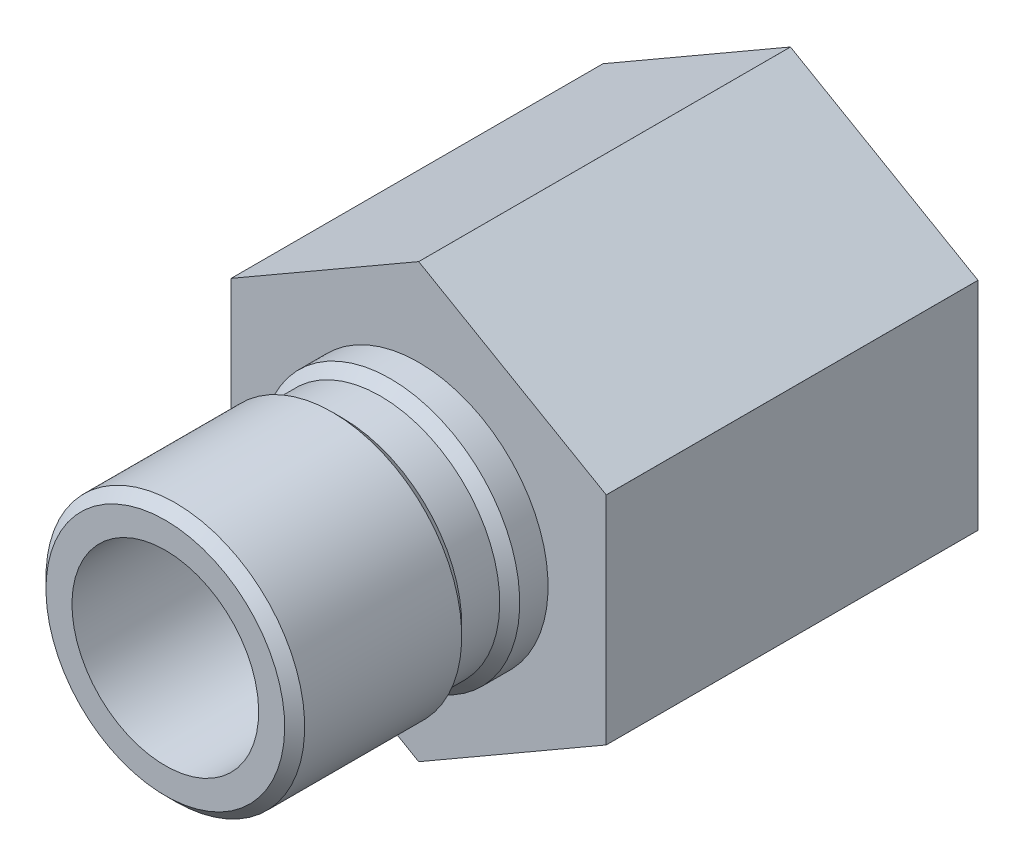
ISO-10303-21;
HEADER;
FILE_DESCRIPTION(('STEP AP214'),'2;1');
FILE_NAME('part.step','',(''),(''),'','','');
FILE_SCHEMA(('AUTOMOTIVE_DESIGN { 1 0 10303 214 1 1 1 1 }'));
ENDSEC;
DATA;
#1=APPLICATION_CONTEXT('core data for automotive mechanical design processes');
#2=APPLICATION_PROTOCOL_DEFINITION('international standard','automotive_design',2000,#1);
#3=PRODUCT_CONTEXT('',#1,'mechanical');
#4=PRODUCT('Part','Part','',(#3));
#5=PRODUCT_RELATED_PRODUCT_CATEGORY('part','',(#4));
#6=PRODUCT_DEFINITION_FORMATION('','',#4);
#7=PRODUCT_DEFINITION_CONTEXT('part definition',#1,'design');
#8=PRODUCT_DEFINITION('design','',#6,#7);
#9=PRODUCT_DEFINITION_SHAPE('','',#8);
#10=(LENGTH_UNIT() NAMED_UNIT(*) SI_UNIT(.MILLI.,.METRE.));
#11=(NAMED_UNIT(*) PLANE_ANGLE_UNIT() SI_UNIT($,.RADIAN.));
#12=(NAMED_UNIT(*) SI_UNIT($,.STERADIAN.) SOLID_ANGLE_UNIT());
#13=UNCERTAINTY_MEASURE_WITH_UNIT(LENGTH_MEASURE(1.E-05),#10,'distance_accuracy_value','');
#14=(GEOMETRIC_REPRESENTATION_CONTEXT(3) GLOBAL_UNCERTAINTY_ASSIGNED_CONTEXT((#13)) GLOBAL_UNIT_ASSIGNED_CONTEXT((#10,
#11,#12)) REPRESENTATION_CONTEXT('',''));
#15=CARTESIAN_POINT('',(0.,0.,0.));
#16=DIRECTION('',(0.,0.,1.));
#17=DIRECTION('',(1.,0.,0.));
#18=AXIS2_PLACEMENT_3D('',#15,#16,#17);
#19=CARTESIAN_POINT('',(0.,9.8552,0.));
#20=DIRECTION('',(0.,0.,1.));
#21=DIRECTION('',(0.,-1.,0.));
#22=AXIS2_PLACEMENT_3D('',#19,#20,#21);
#23=PLANE('',#22);
#24=CARTESIAN_POINT('',(0.,0.,0.));
#25=DIRECTION('',(0.,0.,-1.));
#26=DIRECTION('',(0.,1.,0.));
#27=AXIS2_PLACEMENT_3D('',#24,#25,#26);
#28=CIRCLE('',#27,9.8552);
#29=CARTESIAN_POINT('',(0.,9.8552,0.));
#30=VERTEX_POINT('',#29);
#31=EDGE_CURVE('E153',#30,#30,#28,.T.);
#32=ORIENTED_EDGE('',*,*,#31,.T.);
#33=EDGE_LOOP('',(#32));
#34=FACE_BOUND('',#33,.T.);
#35=CARTESIAN_POINT('',(0.,0.,0.));
#36=DIRECTION('',(0.,0.,-1.));
#37=DIRECTION('',(0.,1.,0.));
#38=AXIS2_PLACEMENT_3D('',#35,#36,#37);
#39=CIRCLE('',#38,16.4973);
#40=CARTESIAN_POINT('',(-0.000838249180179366,16.4972999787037,0.));
#41=VERTEX_POINT('',#40);
#42=CARTESIAN_POINT('',(0.000838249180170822,16.4972999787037,0.));
#43=VERTEX_POINT('',#42);
#44=EDGE_CURVE('E143',#41,#43,#39,.T.);
#45=ORIENTED_EDGE('',*,*,#44,.F.);
#46=DIRECTION('',(-0.866025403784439,-0.5,0.));
#47=VECTOR('',#46,1.);
#48=CARTESIAN_POINT('',(0.,16.4977839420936,0.));
#49=LINE('',#48,#47);
#50=CARTESIAN_POINT('',(-14.2866617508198,8.2493759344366,0.));
#51=VERTEX_POINT('',#50);
#52=EDGE_CURVE('E128',#41,#51,#49,.T.);
#53=ORIENTED_EDGE('',*,*,#52,.T.);
#54=CARTESIAN_POINT('',(-14.2875,8.24792404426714,0.));
#55=VERTEX_POINT('',#54);
#56=EDGE_CURVE('E135',#55,#51,#39,.T.);
#57=ORIENTED_EDGE('',*,*,#56,.F.);
#58=DIRECTION('',(0.,-1.,0.));
#59=VECTOR('',#58,1.);
#60=CARTESIAN_POINT('',(-14.2875,8.24889197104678,0.));
#61=LINE('',#60,#59);
#62=CARTESIAN_POINT('',(-14.2875,-8.24792404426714,0.));
#63=VERTEX_POINT('',#62);
#64=EDGE_CURVE('E119',#55,#63,#61,.T.);
#65=ORIENTED_EDGE('',*,*,#64,.T.);
#66=CARTESIAN_POINT('',(-14.2866617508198,-8.2493759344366,0.));
#67=VERTEX_POINT('',#66);
#68=EDGE_CURVE('E142',#67,#63,#39,.T.);
#69=ORIENTED_EDGE('',*,*,#68,.F.);
#70=DIRECTION('',(0.866025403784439,-0.5,0.));
#71=VECTOR('',#70,1.);
#72=CARTESIAN_POINT('',(-14.2875,-8.24889197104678,0.));
#73=LINE('',#72,#71);
#74=CARTESIAN_POINT('',(-0.000838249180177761,-16.4972999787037,0.));
#75=VERTEX_POINT('',#74);
#76=EDGE_CURVE('E127',#67,#75,#73,.T.);
#77=ORIENTED_EDGE('',*,*,#76,.T.);
#78=CARTESIAN_POINT('',(0.000838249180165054,-16.4972999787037,0.));
#79=VERTEX_POINT('',#78);
#80=EDGE_CURVE('E145',#79,#75,#39,.T.);
#81=ORIENTED_EDGE('',*,*,#80,.F.);
#82=DIRECTION('',(0.866025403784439,0.5,0.));
#83=VECTOR('',#82,1.);
#84=CARTESIAN_POINT('',(0.,-16.4977839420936,0.));
#85=LINE('',#84,#83);
#86=CARTESIAN_POINT('',(14.2866617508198,-8.24937593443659,0.));
#87=VERTEX_POINT('',#86);
#88=EDGE_CURVE('E247',#79,#87,#85,.T.);
#89=ORIENTED_EDGE('',*,*,#88,.T.);
#90=CARTESIAN_POINT('',(14.2875,-8.24792404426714,0.));
#91=VERTEX_POINT('',#90);
#92=EDGE_CURVE('E259',#91,#87,#39,.T.);
#93=ORIENTED_EDGE('',*,*,#92,.F.);
#94=DIRECTION('',(0.,1.,0.));
#95=VECTOR('',#94,1.);
#96=CARTESIAN_POINT('',(14.2875,-8.24889197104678,0.));
#97=LINE('',#96,#95);
#98=CARTESIAN_POINT('',(14.2875,8.24792404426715,0.));
#99=VERTEX_POINT('',#98);
#100=EDGE_CURVE('E244',#91,#99,#97,.T.);
#101=ORIENTED_EDGE('',*,*,#100,.T.);
#102=CARTESIAN_POINT('',(14.2866617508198,8.2493759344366,0.));
#103=VERTEX_POINT('',#102);
#104=EDGE_CURVE('E148',#103,#99,#39,.T.);
#105=ORIENTED_EDGE('',*,*,#104,.F.);
#106=DIRECTION('',(-0.866025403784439,0.5,0.));
#107=VECTOR('',#106,1.);
#108=CARTESIAN_POINT('',(14.2875,8.24889197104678,0.));
#109=LINE('',#108,#107);
#110=EDGE_CURVE('E241',#103,#43,#109,.T.);
#111=ORIENTED_EDGE('',*,*,#110,.T.);
#112=EDGE_LOOP('',(#45,#53,#57,#65,#69,#77,#81,#89,#93,#101,#105,#111));
#113=FACE_BOUND('',#112,.T.);
#114=ADVANCED_FACE('F33',(#34,#113),#23,.T.);
#115=CARTESIAN_POINT('',(0.,0.,0.));
#116=DIRECTION('',(0.,0.,-1.));
#117=DIRECTION('',(0.,1.,0.));
#118=AXIS2_PLACEMENT_3D('',#115,#116,#117);
#119=CYLINDRICAL_SURFACE('',#118,16.4973);
#120=CARTESIAN_POINT('',(0.,0.,-28.321));
#121=DIRECTION('',(0.,0.,-1.));
#122=DIRECTION('',(0.,1.,0.));
#123=AXIS2_PLACEMENT_3D('',#120,#121,#122);
#124=CIRCLE('',#123,16.4973);
#125=CARTESIAN_POINT('',(-0.000838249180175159,16.4972999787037,-28.321));
#126=VERTEX_POINT('',#125);
#127=CARTESIAN_POINT('',(0.000838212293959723,16.4973,-28.321));
#128=VERTEX_POINT('',#127);
#129=EDGE_CURVE('E151',#126,#128,#124,.T.);
#130=ORIENTED_EDGE('',*,*,#129,.F.);
#131=DIRECTION('',(0.,0.,-1.));
#132=VECTOR('',#131,1.);
#133=CARTESIAN_POINT('',(-0.000838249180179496,16.4972999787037,0.));
#134=LINE('',#133,#132);
#135=EDGE_CURVE('E48',#126,#41,#134,.F.);
#136=ORIENTED_EDGE('',*,*,#135,.T.);
#137=ORIENTED_EDGE('',*,*,#44,.T.);
#138=DIRECTION('',(0.,0.,-1.));
#139=VECTOR('',#138,1.);
#140=CARTESIAN_POINT('',(0.000838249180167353,16.4972999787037,0.));
#141=LINE('',#140,#139);
#142=EDGE_CURVE('E223',#43,#128,#141,.T.);
#143=ORIENTED_EDGE('',*,*,#142,.T.);
#144=EDGE_LOOP('',(#130,#136,#137,#143));
#145=FACE_BOUND('',#144,.T.);
#146=ADVANCED_FACE('F284',(#145),#119,.T.);
#147=ORIENTED_EDGE('',*,*,#56,.T.);
#148=DIRECTION('',(0.,0.,-1.));
#149=VECTOR('',#148,1.);
#150=CARTESIAN_POINT('',(-14.2866617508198,8.2493759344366,0.));
#151=LINE('',#150,#149);
#152=CARTESIAN_POINT('',(-14.2866617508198,8.2493759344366,-28.321));
#153=VERTEX_POINT('',#152);
#154=EDGE_CURVE('E220',#51,#153,#151,.T.);
#155=ORIENTED_EDGE('',*,*,#154,.T.);
#156=CARTESIAN_POINT('',(-14.2875,8.24792404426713,-28.321));
#157=VERTEX_POINT('',#156);
#158=EDGE_CURVE('E137',#157,#153,#124,.T.);
#159=ORIENTED_EDGE('',*,*,#158,.F.);
#160=DIRECTION('',(0.,0.,-1.));
#161=VECTOR('',#160,1.);
#162=CARTESIAN_POINT('',(-14.2875,8.24792404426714,0.));
#163=LINE('',#162,#161);
#164=EDGE_CURVE('E55',#157,#55,#163,.F.);
#165=ORIENTED_EDGE('',*,*,#164,.T.);
#166=EDGE_LOOP('',(#147,#155,#159,#165));
#167=FACE_BOUND('',#166,.T.);
#168=ADVANCED_FACE('F133',(#167),#119,.T.);
#169=CARTESIAN_POINT('',(14.2866617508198,8.24937593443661,-28.321));
#170=VERTEX_POINT('',#169);
#171=CARTESIAN_POINT('',(14.2875,8.24792404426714,-28.321));
#172=VERTEX_POINT('',#171);
#173=EDGE_CURVE('E147',#170,#172,#124,.T.);
#174=ORIENTED_EDGE('',*,*,#173,.F.);
#175=DIRECTION('',(0.,0.,-1.));
#176=VECTOR('',#175,1.);
#177=CARTESIAN_POINT('',(14.2866617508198,8.24937593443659,0.));
#178=LINE('',#177,#176);
#179=EDGE_CURVE('E201',#170,#103,#178,.F.);
#180=ORIENTED_EDGE('',*,*,#179,.T.);
#181=ORIENTED_EDGE('',*,*,#104,.T.);
#182=DIRECTION('',(0.,0.,-1.));
#183=VECTOR('',#182,1.);
#184=CARTESIAN_POINT('',(14.2875,8.24792404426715,0.));
#185=LINE('',#184,#183);
#186=EDGE_CURVE('E203',#99,#172,#185,.T.);
#187=ORIENTED_EDGE('',*,*,#186,.T.);
#188=EDGE_LOOP('',(#174,#180,#181,#187));
#189=FACE_BOUND('',#188,.T.);
#190=ADVANCED_FACE('F199',(#189),#119,.T.);
#191=CARTESIAN_POINT('',(14.2875,-8.24792404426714,-28.321));
#192=VERTEX_POINT('',#191);
#193=CARTESIAN_POINT('',(14.2866617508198,-8.2493759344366,-28.321));
#194=VERTEX_POINT('',#193);
#195=EDGE_CURVE('E204',#192,#194,#124,.T.);
#196=ORIENTED_EDGE('',*,*,#195,.F.);
#197=DIRECTION('',(0.,0.,-1.));
#198=VECTOR('',#197,1.);
#199=CARTESIAN_POINT('',(14.2875,-8.24792404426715,0.));
#200=LINE('',#199,#198);
#201=EDGE_CURVE('E225',#192,#91,#200,.F.);
#202=ORIENTED_EDGE('',*,*,#201,.T.);
#203=ORIENTED_EDGE('',*,*,#92,.T.);
#204=DIRECTION('',(0.,0.,-1.));
#205=VECTOR('',#204,1.);
#206=CARTESIAN_POINT('',(14.2866617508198,-8.24937593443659,0.));
#207=LINE('',#206,#205);
#208=EDGE_CURVE('E232',#87,#194,#207,.T.);
#209=ORIENTED_EDGE('',*,*,#208,.T.);
#210=EDGE_LOOP('',(#196,#202,#203,#209));
#211=FACE_BOUND('',#210,.T.);
#212=ADVANCED_FACE('F266',(#211),#119,.T.);
#213=CARTESIAN_POINT('',(0.000838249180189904,-16.4972999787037,-28.321));
#214=VERTEX_POINT('',#213);
#215=CARTESIAN_POINT('',(-0.00083821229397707,-16.4973,-28.321));
#216=VERTEX_POINT('',#215);
#217=EDGE_CURVE('E206',#214,#216,#124,.T.);
#218=ORIENTED_EDGE('',*,*,#217,.F.);
#219=DIRECTION('',(0.,0.,-1.));
#220=VECTOR('',#219,1.);
#221=CARTESIAN_POINT('',(0.000838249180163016,-16.4972999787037,0.));
#222=LINE('',#221,#220);
#223=EDGE_CURVE('E229',#214,#79,#222,.F.);
#224=ORIENTED_EDGE('',*,*,#223,.T.);
#225=ORIENTED_EDGE('',*,*,#80,.T.);
#226=DIRECTION('',(0.,0.,-1.));
#227=VECTOR('',#226,1.);
#228=CARTESIAN_POINT('',(-0.000838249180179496,-16.4972999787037,0.));
#229=LINE('',#228,#227);
#230=EDGE_CURVE('E138',#75,#216,#229,.T.);
#231=ORIENTED_EDGE('',*,*,#230,.T.);
#232=EDGE_LOOP('',(#218,#224,#225,#231));
#233=FACE_BOUND('',#232,.T.);
#234=ADVANCED_FACE('F257',(#233),#119,.T.);
#235=CARTESIAN_POINT('',(-14.2866617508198,-8.24937593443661,-28.321));
#236=VERTEX_POINT('',#235);
#237=CARTESIAN_POINT('',(-14.2875,-8.24792404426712,-28.321));
#238=VERTEX_POINT('',#237);
#239=EDGE_CURVE('E208',#236,#238,#124,.T.);
#240=ORIENTED_EDGE('',*,*,#239,.F.);
#241=DIRECTION('',(0.,0.,-1.));
#242=VECTOR('',#241,1.);
#243=CARTESIAN_POINT('',(-14.2866617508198,-8.2493759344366,0.));
#244=LINE('',#243,#242);
#245=EDGE_CURVE('E235',#236,#67,#244,.F.);
#246=ORIENTED_EDGE('',*,*,#245,.T.);
#247=ORIENTED_EDGE('',*,*,#68,.T.);
#248=DIRECTION('',(0.,0.,-1.));
#249=VECTOR('',#248,1.);
#250=CARTESIAN_POINT('',(-14.2875,-8.24792404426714,0.));
#251=LINE('',#250,#249);
#252=EDGE_CURVE('E122',#63,#238,#251,.T.);
#253=ORIENTED_EDGE('',*,*,#252,.T.);
#254=EDGE_LOOP('',(#240,#246,#247,#253));
#255=FACE_BOUND('',#254,.T.);
#256=ADVANCED_FACE('F271',(#255),#119,.T.);
#257=CARTESIAN_POINT('',(0.,16.4973,-28.321));
#258=DIRECTION('',(0.,0.,-1.));
#259=DIRECTION('',(0.,1.,0.));
#260=AXIS2_PLACEMENT_3D('',#257,#258,#259);
#261=PLANE('',#260);
#262=CARTESIAN_POINT('',(0.,0.,-28.321));
#263=DIRECTION('',(0.,0.,-1.));
#264=DIRECTION('',(0.,1.,0.));
#265=AXIS2_PLACEMENT_3D('',#262,#263,#264);
#266=CIRCLE('',#265,12.3034389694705);
#267=CARTESIAN_POINT('',(0.,12.3034389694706,-28.321));
#268=VERTEX_POINT('',#267);
#269=EDGE_CURVE('E207',#268,#268,#266,.T.);
#270=ORIENTED_EDGE('',*,*,#269,.F.);
#271=EDGE_LOOP('',(#270));
#272=FACE_BOUND('',#271,.T.);
#273=ORIENTED_EDGE('',*,*,#158,.T.);
#274=DIRECTION('',(0.866025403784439,0.5,0.));
#275=VECTOR('',#274,1.);
#276=CARTESIAN_POINT('',(-0.000209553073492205,16.4976629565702,-28.321));
#277=LINE('',#276,#275);
#278=EDGE_CURVE('E12',#153,#126,#277,.T.);
#279=ORIENTED_EDGE('',*,*,#278,.T.);
#280=ORIENTED_EDGE('',*,*,#129,.T.);
#281=DIRECTION('',(0.866025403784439,-0.5,0.));
#282=VECTOR('',#281,1.);
#283=CARTESIAN_POINT('',(0.000209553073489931,16.4976629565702,-28.321));
#284=LINE('',#283,#282);
#285=EDGE_CURVE('E41',#128,#170,#284,.T.);
#286=ORIENTED_EDGE('',*,*,#285,.T.);
#287=ORIENTED_EDGE('',*,*,#173,.T.);
#288=DIRECTION('',(0.,-1.,0.));
#289=VECTOR('',#288,1.);
#290=CARTESIAN_POINT('',(14.2875,16.4973,-28.321));
#291=LINE('',#290,#289);
#292=EDGE_CURVE('E185',#172,#192,#291,.T.);
#293=ORIENTED_EDGE('',*,*,#292,.T.);
#294=ORIENTED_EDGE('',*,*,#195,.T.);
#295=DIRECTION('',(-0.866025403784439,-0.5,0.));
#296=VECTOR('',#295,1.);
#297=CARTESIAN_POINT('',(14.2872904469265,-8.24901295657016,-28.321));
#298=LINE('',#297,#296);
#299=EDGE_CURVE('E182',#194,#214,#298,.T.);
#300=ORIENTED_EDGE('',*,*,#299,.T.);
#301=ORIENTED_EDGE('',*,*,#217,.T.);
#302=DIRECTION('',(-0.866025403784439,0.5,0.));
#303=VECTOR('',#302,1.);
#304=CARTESIAN_POINT('',(-14.2872904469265,-8.24901295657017,-28.321));
#305=LINE('',#304,#303);
#306=EDGE_CURVE('E179',#216,#236,#305,.T.);
#307=ORIENTED_EDGE('',*,*,#306,.T.);
#308=ORIENTED_EDGE('',*,*,#239,.T.);
#309=DIRECTION('',(0.,1.,0.));
#310=VECTOR('',#309,1.);
#311=CARTESIAN_POINT('',(-14.2875,16.4973,-28.321));
#312=LINE('',#311,#310);
#313=EDGE_CURVE('E177',#238,#157,#312,.T.);
#314=ORIENTED_EDGE('',*,*,#313,.T.);
#315=EDGE_LOOP('',(#273,#279,#280,#286,#287,#293,#294,#300,#301,#307,#308,#314));
#316=FACE_BOUND('',#315,.T.);
#317=ADVANCED_FACE('F192',(#272,#316),#261,.T.);
#318=CARTESIAN_POINT('',(0.,0.,0.));
#319=DIRECTION('',(0.,0.,-1.));
#320=DIRECTION('',(0.,1.,0.));
#321=AXIS2_PLACEMENT_3D('',#318,#319,#320);
#322=CYLINDRICAL_SURFACE('',#321,7.112);
#323=CARTESIAN_POINT('',(0.,0.,-6.82719432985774));
#324=DIRECTION('',(0.,0.,-1.));
#325=DIRECTION('',(0.,1.,0.));
#326=AXIS2_PLACEMENT_3D('',#323,#324,#325);
#327=CIRCLE('',#326,7.112);
#328=CARTESIAN_POINT('',(0.,7.112,-6.82719432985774));
#329=VERTEX_POINT('',#328);
#330=EDGE_CURVE('E214',#329,#329,#327,.T.);
#331=ORIENTED_EDGE('',*,*,#330,.T.);
#332=EDGE_LOOP('',(#331));
#333=FACE_BOUND('',#332,.T.);
#334=CARTESIAN_POINT('',(0.,0.,19.304));
#335=DIRECTION('',(0.,0.,-1.));
#336=DIRECTION('',(0.,1.,0.));
#337=AXIS2_PLACEMENT_3D('',#334,#335,#336);
#338=CIRCLE('',#337,7.112);
#339=CARTESIAN_POINT('',(0.,7.112,19.304));
#340=VERTEX_POINT('',#339);
#341=EDGE_CURVE('E174',#340,#340,#338,.T.);
#342=ORIENTED_EDGE('',*,*,#341,.F.);
#343=EDGE_LOOP('',(#342));
#344=FACE_BOUND('',#343,.T.);
#345=ADVANCED_FACE('F35',(#333,#344),#322,.F.);
#346=CARTESIAN_POINT('',(0.,7.112,19.304));
#347=DIRECTION('',(0.,0.,1.));
#348=DIRECTION('',(0.,-1.,0.));
#349=AXIS2_PLACEMENT_3D('',#346,#347,#348);
#350=PLANE('',#349);
#351=ORIENTED_EDGE('',*,*,#341,.T.);
#352=EDGE_LOOP('',(#351));
#353=FACE_BOUND('',#352,.T.);
#354=CARTESIAN_POINT('',(0.,0.,19.304));
#355=DIRECTION('',(0.,0.,-1.));
#356=DIRECTION('',(0.,1.,0.));
#357=AXIS2_PLACEMENT_3D('',#354,#355,#356);
#358=CIRCLE('',#357,9.0932);
#359=CARTESIAN_POINT('',(0.,9.0932,19.304));
#360=VERTEX_POINT('',#359);
#361=EDGE_CURVE('E171',#360,#360,#358,.T.);
#362=ORIENTED_EDGE('',*,*,#361,.F.);
#363=EDGE_LOOP('',(#362));
#364=FACE_BOUND('',#363,.T.);
#365=ADVANCED_FACE('F317',(#353,#364),#350,.T.);
#366=CARTESIAN_POINT('',(0.,0.,18.542));
#367=DIRECTION('',(0.,0.,-1.));
#368=DIRECTION('',(0.,1.,0.));
#369=AXIS2_PLACEMENT_3D('',#366,#367,#368);
#370=CONICAL_SURFACE('',#369,9.8552,0.785398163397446);
#371=ORIENTED_EDGE('',*,*,#361,.T.);
#372=EDGE_LOOP('',(#371));
#373=FACE_BOUND('',#372,.T.);
#374=CARTESIAN_POINT('',(0.,0.,18.542));
#375=DIRECTION('',(0.,0.,-1.));
#376=DIRECTION('',(0.,1.,0.));
#377=AXIS2_PLACEMENT_3D('',#374,#375,#376);
#378=CIRCLE('',#377,9.8552);
#379=CARTESIAN_POINT('',(0.,9.8552,18.542));
#380=VERTEX_POINT('',#379);
#381=EDGE_CURVE('E168',#380,#380,#378,.T.);
#382=ORIENTED_EDGE('',*,*,#381,.F.);
#383=EDGE_LOOP('',(#382));
#384=FACE_BOUND('',#383,.T.);
#385=ADVANCED_FACE('F314',(#373,#384),#370,.T.);
#386=CARTESIAN_POINT('',(0.,0.,0.));
#387=DIRECTION('',(0.,0.,-1.));
#388=DIRECTION('',(0.,1.,0.));
#389=AXIS2_PLACEMENT_3D('',#386,#387,#388);
#390=CYLINDRICAL_SURFACE('',#389,9.8552);
#391=ORIENTED_EDGE('',*,*,#381,.T.);
#392=EDGE_LOOP('',(#391));
#393=FACE_BOUND('',#392,.T.);
#394=CARTESIAN_POINT('',(0.,0.,6.5786));
#395=DIRECTION('',(0.,0.,-1.));
#396=DIRECTION('',(0.,1.,0.));
#397=AXIS2_PLACEMENT_3D('',#394,#395,#396);
#398=CIRCLE('',#397,9.8552);
#399=CARTESIAN_POINT('',(0.,9.8552,6.5786));
#400=VERTEX_POINT('',#399);
#401=EDGE_CURVE('E165',#400,#400,#398,.T.);
#402=ORIENTED_EDGE('',*,*,#401,.F.);
#403=EDGE_LOOP('',(#402));
#404=FACE_BOUND('',#403,.T.);
#405=ADVANCED_FACE('F310',(#393,#404),#390,.T.);
#406=CARTESIAN_POINT('',(0.,0.,5.8166));
#407=DIRECTION('',(0.,0.,1.));
#408=DIRECTION('',(0.,-1.,0.));
#409=AXIS2_PLACEMENT_3D('',#406,#407,#408);
#410=CONICAL_SURFACE('',#409,9.0932,0.785398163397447);
#411=ORIENTED_EDGE('',*,*,#401,.T.);
#412=EDGE_LOOP('',(#411));
#413=FACE_BOUND('',#412,.T.);
#414=CARTESIAN_POINT('',(0.,0.,5.8166));
#415=DIRECTION('',(0.,0.,-1.));
#416=DIRECTION('',(0.,1.,0.));
#417=AXIS2_PLACEMENT_3D('',#414,#415,#416);
#418=CIRCLE('',#417,9.0932);
#419=CARTESIAN_POINT('',(0.,9.0932,5.8166));
#420=VERTEX_POINT('',#419);
#421=EDGE_CURVE('E162',#420,#420,#418,.T.);
#422=ORIENTED_EDGE('',*,*,#421,.F.);
#423=EDGE_LOOP('',(#422));
#424=FACE_BOUND('',#423,.T.);
#425=ADVANCED_FACE('F306',(#413,#424),#410,.T.);
#426=CARTESIAN_POINT('',(0.,0.,0.));
#427=DIRECTION('',(0.,0.,-1.));
#428=DIRECTION('',(0.,1.,0.));
#429=AXIS2_PLACEMENT_3D('',#426,#427,#428);
#430=CYLINDRICAL_SURFACE('',#429,9.0932);
#431=ORIENTED_EDGE('',*,*,#421,.T.);
#432=EDGE_LOOP('',(#431));
#433=FACE_BOUND('',#432,.T.);
#434=CARTESIAN_POINT('',(0.,0.,2.921));
#435=DIRECTION('',(0.,0.,-1.));
#436=DIRECTION('',(0.,1.,0.));
#437=AXIS2_PLACEMENT_3D('',#434,#435,#436);
#438=CIRCLE('',#437,9.0932);
#439=CARTESIAN_POINT('',(0.,9.0932,2.921));
#440=VERTEX_POINT('',#439);
#441=EDGE_CURVE('E159',#440,#440,#438,.T.);
#442=ORIENTED_EDGE('',*,*,#441,.F.);
#443=EDGE_LOOP('',(#442));
#444=FACE_BOUND('',#443,.T.);
#445=ADVANCED_FACE('F302',(#433,#444),#430,.T.);
#446=CARTESIAN_POINT('',(0.,0.,2.159));
#447=DIRECTION('',(0.,0.,-1.));
#448=DIRECTION('',(0.,1.,0.));
#449=AXIS2_PLACEMENT_3D('',#446,#447,#448);
#450=CONICAL_SURFACE('',#449,9.8552,0.785398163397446);
#451=ORIENTED_EDGE('',*,*,#441,.T.);
#452=EDGE_LOOP('',(#451));
#453=FACE_BOUND('',#452,.T.);
#454=CARTESIAN_POINT('',(0.,0.,2.159));
#455=DIRECTION('',(0.,0.,-1.));
#456=DIRECTION('',(0.,1.,0.));
#457=AXIS2_PLACEMENT_3D('',#454,#455,#456);
#458=CIRCLE('',#457,9.8552);
#459=CARTESIAN_POINT('',(0.,9.8552,2.159));
#460=VERTEX_POINT('',#459);
#461=EDGE_CURVE('E156',#460,#460,#458,.T.);
#462=ORIENTED_EDGE('',*,*,#461,.F.);
#463=EDGE_LOOP('',(#462));
#464=FACE_BOUND('',#463,.T.);
#465=ADVANCED_FACE('F298',(#453,#464),#450,.T.);
#466=CARTESIAN_POINT('',(0.,0.,0.));
#467=DIRECTION('',(0.,0.,-1.));
#468=DIRECTION('',(0.,1.,0.));
#469=AXIS2_PLACEMENT_3D('',#466,#467,#468);
#470=CYLINDRICAL_SURFACE('',#469,9.8552);
#471=ORIENTED_EDGE('',*,*,#461,.T.);
#472=EDGE_LOOP('',(#471));
#473=FACE_BOUND('',#472,.T.);
#474=ORIENTED_EDGE('',*,*,#31,.F.);
#475=EDGE_LOOP('',(#474));
#476=FACE_BOUND('',#475,.T.);
#477=ADVANCED_FACE('F294',(#473,#476),#470,.T.);
#478=CARTESIAN_POINT('',(0.,0.,-9.271));
#479=DIRECTION('',(0.,0.,-1.));
#480=DIRECTION('',(0.,1.,0.));
#481=AXIS2_PLACEMENT_3D('',#478,#479,#480);
#482=CONICAL_SURFACE('',#481,11.70813,0.0312396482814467);
#483=ORIENTED_EDGE('',*,*,#269,.T.);
#484=EDGE_LOOP('',(#483));
#485=FACE_BOUND('',#484,.T.);
#486=CARTESIAN_POINT('',(0.,0.,-9.271));
#487=DIRECTION('',(0.,0.,-1.));
#488=DIRECTION('',(0.,1.,0.));
#489=AXIS2_PLACEMENT_3D('',#486,#487,#488);
#490=CIRCLE('',#489,11.70813);
#491=CARTESIAN_POINT('',(0.,11.70813,-9.271));
#492=VERTEX_POINT('',#491);
#493=EDGE_CURVE('E210',#492,#492,#490,.T.);
#494=ORIENTED_EDGE('',*,*,#493,.F.);
#495=EDGE_LOOP('',(#494));
#496=FACE_BOUND('',#495,.T.);
#497=ADVANCED_FACE('F297',(#485,#496),#482,.F.);
#498=CARTESIAN_POINT('',(0.,0.,-6.82719432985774));
#499=DIRECTION('',(0.,0.,-1.));
#500=DIRECTION('',(0.,1.,0.));
#501=AXIS2_PLACEMENT_3D('',#498,#499,#500);
#502=CONICAL_SURFACE('',#501,7.112,1.08210413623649);
#503=ORIENTED_EDGE('',*,*,#493,.T.);
#504=EDGE_LOOP('',(#503));
#505=FACE_BOUND('',#504,.T.);
#506=ORIENTED_EDGE('',*,*,#330,.F.);
#507=EDGE_LOOP('',(#506));
#508=FACE_BOUND('',#507,.T.);
#509=ADVANCED_FACE('F281',(#505,#508),#502,.F.);
#510=CARTESIAN_POINT('',(-14.2875,8.24889197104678,-28.321));
#511=DIRECTION('',(-1.,0.,0.));
#512=DIRECTION('',(0.,0.,1.));
#513=AXIS2_PLACEMENT_3D('',#510,#511,#512);
#514=PLANE('',#513);
#515=ORIENTED_EDGE('',*,*,#313,.F.);
#516=ORIENTED_EDGE('',*,*,#252,.F.);
#517=ORIENTED_EDGE('',*,*,#64,.F.);
#518=ORIENTED_EDGE('',*,*,#164,.F.);
#519=EDGE_LOOP('',(#515,#516,#517,#518));
#520=FACE_BOUND('',#519,.T.);
#521=ADVANCED_FACE('F120',(#520),#514,.T.);
#522=CARTESIAN_POINT('',(-14.2875,-8.24889197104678,-28.321));
#523=DIRECTION('',(-0.5,-0.866025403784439,0.));
#524=DIRECTION('',(0.866025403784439,-0.5,0.));
#525=AXIS2_PLACEMENT_3D('',#522,#523,#524);
#526=PLANE('',#525);
#527=ORIENTED_EDGE('',*,*,#306,.F.);
#528=ORIENTED_EDGE('',*,*,#230,.F.);
#529=ORIENTED_EDGE('',*,*,#76,.F.);
#530=ORIENTED_EDGE('',*,*,#245,.F.);
#531=EDGE_LOOP('',(#527,#528,#529,#530));
#532=FACE_BOUND('',#531,.T.);
#533=ADVANCED_FACE('F272',(#532),#526,.T.);
#534=CARTESIAN_POINT('',(0.,-16.4977839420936,-28.321));
#535=DIRECTION('',(0.5,-0.866025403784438,0.));
#536=DIRECTION('',(0.866025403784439,0.5,0.));
#537=AXIS2_PLACEMENT_3D('',#534,#535,#536);
#538=PLANE('',#537);
#539=ORIENTED_EDGE('',*,*,#299,.F.);
#540=ORIENTED_EDGE('',*,*,#208,.F.);
#541=ORIENTED_EDGE('',*,*,#88,.F.);
#542=ORIENTED_EDGE('',*,*,#223,.F.);
#543=EDGE_LOOP('',(#539,#540,#541,#542));
#544=FACE_BOUND('',#543,.T.);
#545=ADVANCED_FACE('F274',(#544),#538,.T.);
#546=CARTESIAN_POINT('',(14.2875,-8.24889197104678,-28.321));
#547=DIRECTION('',(1.,0.,0.));
#548=DIRECTION('',(0.,0.,-1.));
#549=AXIS2_PLACEMENT_3D('',#546,#547,#548);
#550=PLANE('',#549);
#551=ORIENTED_EDGE('',*,*,#292,.F.);
#552=ORIENTED_EDGE('',*,*,#186,.F.);
#553=ORIENTED_EDGE('',*,*,#100,.F.);
#554=ORIENTED_EDGE('',*,*,#201,.F.);
#555=EDGE_LOOP('',(#551,#552,#553,#554));
#556=FACE_BOUND('',#555,.T.);
#557=ADVANCED_FACE('F264',(#556),#550,.T.);
#558=CARTESIAN_POINT('',(14.2875,8.24889197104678,-28.321));
#559=DIRECTION('',(0.5,0.866025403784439,0.));
#560=DIRECTION('',(-0.866025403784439,0.5,0.));
#561=AXIS2_PLACEMENT_3D('',#558,#559,#560);
#562=PLANE('',#561);
#563=ORIENTED_EDGE('',*,*,#285,.F.);
#564=ORIENTED_EDGE('',*,*,#142,.F.);
#565=ORIENTED_EDGE('',*,*,#110,.F.);
#566=ORIENTED_EDGE('',*,*,#179,.F.);
#567=EDGE_LOOP('',(#563,#564,#565,#566));
#568=FACE_BOUND('',#567,.T.);
#569=ADVANCED_FACE('F357',(#568),#562,.T.);
#570=CARTESIAN_POINT('',(0.,16.4977839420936,-28.321));
#571=DIRECTION('',(-0.5,0.866025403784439,0.));
#572=DIRECTION('',(-0.866025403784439,-0.5,0.));
#573=AXIS2_PLACEMENT_3D('',#570,#571,#572);
#574=PLANE('',#573);
#575=ORIENTED_EDGE('',*,*,#278,.F.);
#576=ORIENTED_EDGE('',*,*,#154,.F.);
#577=ORIENTED_EDGE('',*,*,#52,.F.);
#578=ORIENTED_EDGE('',*,*,#135,.F.);
#579=EDGE_LOOP('',(#575,#576,#577,#578));
#580=FACE_BOUND('',#579,.T.);
#581=ADVANCED_FACE('F355',(#580),#574,.T.);
#582=CLOSED_SHELL('',(#114,#146,#168,#190,#212,#234,#256,#317,#345,#365,#385,#405,#425,#445,
#465,#477,#497,#509,#521,#533,#545,#557,#569,#581));
#583=MANIFOLD_SOLID_BREP('B2',#582);
#584=ADVANCED_BREP_SHAPE_REPRESENTATION('',(#18,#583),#14);
#585=SHAPE_DEFINITION_REPRESENTATION(#9,#584);
ENDSEC;
END-ISO-10303-21;
